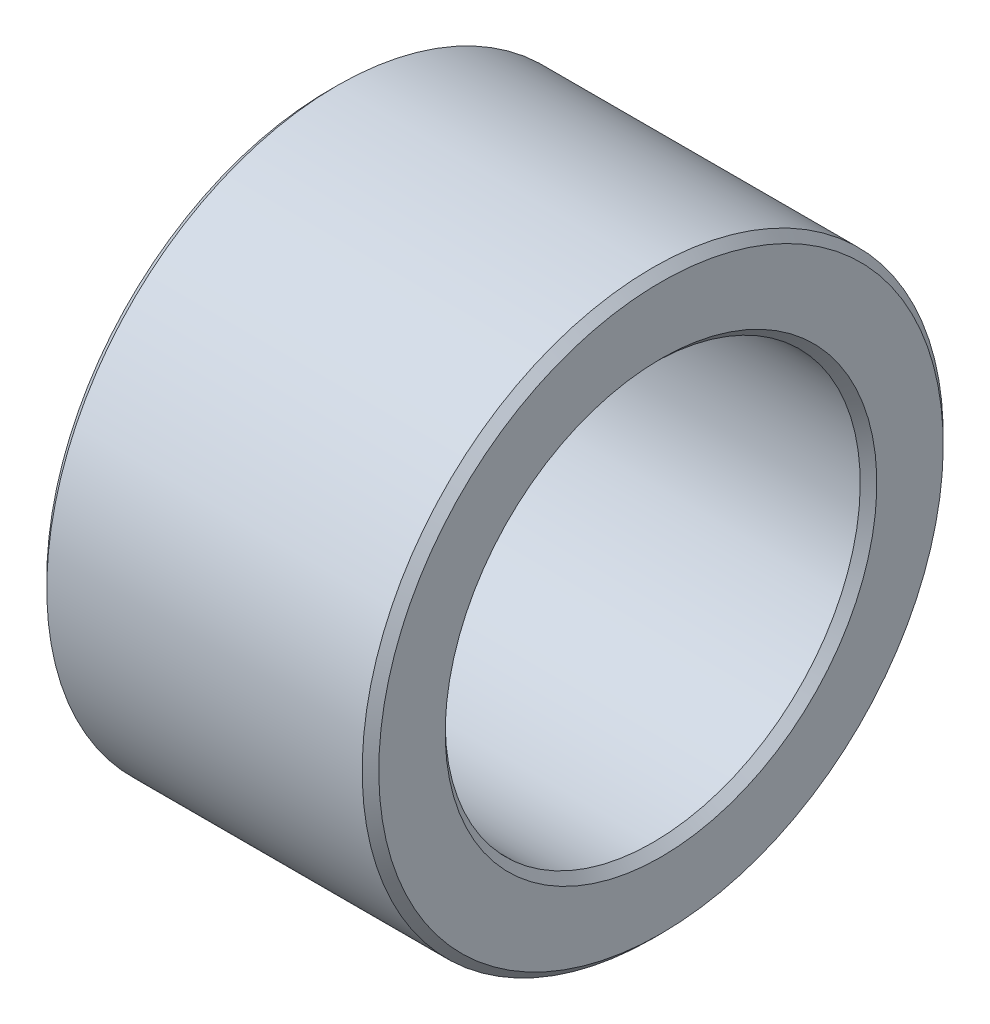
ISO-10303-21;
HEADER;
FILE_DESCRIPTION(('STEP AP214'),'2;1');
FILE_NAME('part.step','',(''),(''),'','','');
FILE_SCHEMA(('AUTOMOTIVE_DESIGN { 1 0 10303 214 1 1 1 1 }'));
ENDSEC;
DATA;
#1=APPLICATION_CONTEXT('core data for automotive mechanical design processes');
#2=APPLICATION_PROTOCOL_DEFINITION('international standard','automotive_design',2000,#1);
#3=PRODUCT_CONTEXT('',#1,'mechanical');
#4=PRODUCT('Part','Part','',(#3));
#5=PRODUCT_RELATED_PRODUCT_CATEGORY('part','',(#4));
#6=PRODUCT_DEFINITION_FORMATION('','',#4);
#7=PRODUCT_DEFINITION_CONTEXT('part definition',#1,'design');
#8=PRODUCT_DEFINITION('design','',#6,#7);
#9=PRODUCT_DEFINITION_SHAPE('','',#8);
#10=(LENGTH_UNIT() NAMED_UNIT(*) SI_UNIT(.MILLI.,.METRE.));
#11=(NAMED_UNIT(*) PLANE_ANGLE_UNIT() SI_UNIT($,.RADIAN.));
#12=(NAMED_UNIT(*) SI_UNIT($,.STERADIAN.) SOLID_ANGLE_UNIT());
#13=UNCERTAINTY_MEASURE_WITH_UNIT(LENGTH_MEASURE(1.E-05),#10,'distance_accuracy_value','');
#14=(GEOMETRIC_REPRESENTATION_CONTEXT(3) GLOBAL_UNCERTAINTY_ASSIGNED_CONTEXT((#13)) GLOBAL_UNIT_ASSIGNED_CONTEXT((#10,
#11,#12)) REPRESENTATION_CONTEXT('',''));
#15=CARTESIAN_POINT('',(0.,0.,0.));
#16=DIRECTION('',(0.,0.,1.));
#17=DIRECTION('',(1.,0.,0.));
#18=AXIS2_PLACEMENT_3D('',#15,#16,#17);
#19=CARTESIAN_POINT('',(0.,-12.,0.));
#20=DIRECTION('',(-1.,0.,0.));
#21=DIRECTION('',(0.,1.,0.));
#22=AXIS2_PLACEMENT_3D('',#19,#20,#21);
#23=PLANE('',#22);
#24=CARTESIAN_POINT('',(0.,0.,0.));
#25=DIRECTION('',(1.,0.,0.));
#26=DIRECTION('',(0.,-1.,0.));
#27=AXIS2_PLACEMENT_3D('',#24,#25,#26);
#28=CIRCLE('',#27,10.4);
#29=CARTESIAN_POINT('',(0.,-10.4,0.));
#30=VERTEX_POINT('',#29);
#31=EDGE_CURVE('E9',#30,#30,#28,.T.);
#32=ORIENTED_EDGE('',*,*,#31,.T.);
#33=EDGE_LOOP('',(#32));
#34=FACE_BOUND('',#33,.T.);
#35=CARTESIAN_POINT('',(0.,0.,0.));
#36=DIRECTION('',(1.,0.,0.));
#37=DIRECTION('',(0.,-1.,0.));
#38=AXIS2_PLACEMENT_3D('',#35,#36,#37);
#39=CIRCLE('',#38,13.6);
#40=CARTESIAN_POINT('',(0.,-13.6,0.));
#41=VERTEX_POINT('',#40);
#42=EDGE_CURVE('E53',#41,#41,#39,.T.);
#43=ORIENTED_EDGE('',*,*,#42,.F.);
#44=EDGE_LOOP('',(#43));
#45=FACE_BOUND('',#44,.T.);
#46=ADVANCED_FACE('F15',(#34,#45),#23,.T.);
#47=CARTESIAN_POINT('',(0.2,0.,0.));
#48=DIRECTION('',(-1.,0.,0.));
#49=DIRECTION('',(0.,-1.,0.));
#50=AXIS2_PLACEMENT_3D('',#47,#48,#49);
#51=CONICAL_SURFACE('',#50,10.2,0.785398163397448);
#52=CARTESIAN_POINT('',(0.4,0.,0.));
#53=DIRECTION('',(1.,0.,0.));
#54=DIRECTION('',(0.,-1.,0.));
#55=AXIS2_PLACEMENT_3D('',#52,#53,#54);
#56=CIRCLE('',#55,10.);
#57=CARTESIAN_POINT('',(0.4,-10.,0.));
#58=VERTEX_POINT('',#57);
#59=EDGE_CURVE('E22',#58,#58,#56,.T.);
#60=ORIENTED_EDGE('',*,*,#59,.T.);
#61=EDGE_LOOP('',(#60));
#62=FACE_BOUND('',#61,.T.);
#63=ORIENTED_EDGE('',*,*,#31,.F.);
#64=EDGE_LOOP('',(#63));
#65=FACE_BOUND('',#64,.T.);
#66=ADVANCED_FACE('F82',(#62,#65),#51,.F.);
#67=CARTESIAN_POINT('',(8.,0.,0.));
#68=DIRECTION('',(-1.,0.,0.));
#69=DIRECTION('',(0.,-1.,0.));
#70=AXIS2_PLACEMENT_3D('',#67,#68,#69);
#71=CYLINDRICAL_SURFACE('',#70,10.);
#72=CARTESIAN_POINT('',(15.6,0.,0.));
#73=DIRECTION('',(1.,0.,0.));
#74=DIRECTION('',(0.,-1.,0.));
#75=AXIS2_PLACEMENT_3D('',#72,#73,#74);
#76=CIRCLE('',#75,10.);
#77=CARTESIAN_POINT('',(15.6,-10.,0.));
#78=VERTEX_POINT('',#77);
#79=EDGE_CURVE('E58',#78,#78,#76,.T.);
#80=ORIENTED_EDGE('',*,*,#79,.T.);
#81=EDGE_LOOP('',(#80));
#82=FACE_BOUND('',#81,.T.);
#83=ORIENTED_EDGE('',*,*,#59,.F.);
#84=EDGE_LOOP('',(#83));
#85=FACE_BOUND('',#84,.T.);
#86=ADVANCED_FACE('F66',(#82,#85),#71,.F.);
#87=CARTESIAN_POINT('',(15.8,0.,0.));
#88=DIRECTION('',(1.,0.,0.));
#89=DIRECTION('',(0.,-1.,0.));
#90=AXIS2_PLACEMENT_3D('',#87,#88,#89);
#91=CONICAL_SURFACE('',#90,10.2,0.785398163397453);
#92=CARTESIAN_POINT('',(16.,0.,0.));
#93=DIRECTION('',(1.,0.,0.));
#94=DIRECTION('',(0.,-1.,0.));
#95=AXIS2_PLACEMENT_3D('',#92,#93,#94);
#96=CIRCLE('',#95,10.4);
#97=CARTESIAN_POINT('',(16.,-10.4,0.));
#98=VERTEX_POINT('',#97);
#99=EDGE_CURVE('E63',#98,#98,#96,.T.);
#100=ORIENTED_EDGE('',*,*,#99,.T.);
#101=EDGE_LOOP('',(#100));
#102=FACE_BOUND('',#101,.T.);
#103=ORIENTED_EDGE('',*,*,#79,.F.);
#104=EDGE_LOOP('',(#103));
#105=FACE_BOUND('',#104,.T.);
#106=ADVANCED_FACE('F69',(#102,#105),#91,.F.);
#107=CARTESIAN_POINT('',(16.,-12.,0.));
#108=DIRECTION('',(1.,0.,0.));
#109=DIRECTION('',(0.,-1.,0.));
#110=AXIS2_PLACEMENT_3D('',#107,#108,#109);
#111=PLANE('',#110);
#112=CARTESIAN_POINT('',(16.,0.,0.));
#113=DIRECTION('',(1.,0.,0.));
#114=DIRECTION('',(0.,-1.,0.));
#115=AXIS2_PLACEMENT_3D('',#112,#113,#114);
#116=CIRCLE('',#115,13.6);
#117=CARTESIAN_POINT('',(16.,-13.6,0.));
#118=VERTEX_POINT('',#117);
#119=EDGE_CURVE('E61',#118,#118,#116,.T.);
#120=ORIENTED_EDGE('',*,*,#119,.T.);
#121=EDGE_LOOP('',(#120));
#122=FACE_BOUND('',#121,.T.);
#123=ORIENTED_EDGE('',*,*,#99,.F.);
#124=EDGE_LOOP('',(#123));
#125=FACE_BOUND('',#124,.T.);
#126=ADVANCED_FACE('F71',(#122,#125),#111,.T.);
#127=CARTESIAN_POINT('',(15.8,0.,0.));
#128=DIRECTION('',(-1.,0.,0.));
#129=DIRECTION('',(0.,-1.,0.));
#130=AXIS2_PLACEMENT_3D('',#127,#128,#129);
#131=CONICAL_SURFACE('',#130,13.8,0.785398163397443);
#132=CARTESIAN_POINT('',(15.6,0.,0.));
#133=DIRECTION('',(1.,0.,0.));
#134=DIRECTION('',(0.,-1.,0.));
#135=AXIS2_PLACEMENT_3D('',#132,#133,#134);
#136=CIRCLE('',#135,14.);
#137=CARTESIAN_POINT('',(15.6,-14.,0.));
#138=VERTEX_POINT('',#137);
#139=EDGE_CURVE('E55',#138,#138,#136,.T.);
#140=ORIENTED_EDGE('',*,*,#139,.T.);
#141=EDGE_LOOP('',(#140));
#142=FACE_BOUND('',#141,.T.);
#143=ORIENTED_EDGE('',*,*,#119,.F.);
#144=EDGE_LOOP('',(#143));
#145=FACE_BOUND('',#144,.T.);
#146=ADVANCED_FACE('F79',(#142,#145),#131,.T.);
#147=CARTESIAN_POINT('',(8.,0.,0.));
#148=DIRECTION('',(-1.,0.,0.));
#149=DIRECTION('',(0.,-1.,0.));
#150=AXIS2_PLACEMENT_3D('',#147,#148,#149);
#151=CYLINDRICAL_SURFACE('',#150,14.);
#152=CARTESIAN_POINT('',(0.4,0.,0.));
#153=DIRECTION('',(1.,0.,0.));
#154=DIRECTION('',(0.,-1.,0.));
#155=AXIS2_PLACEMENT_3D('',#152,#153,#154);
#156=CIRCLE('',#155,14.);
#157=CARTESIAN_POINT('',(0.4,-14.,0.));
#158=VERTEX_POINT('',#157);
#159=EDGE_CURVE('E49',#158,#158,#156,.T.);
#160=ORIENTED_EDGE('',*,*,#159,.T.);
#161=EDGE_LOOP('',(#160));
#162=FACE_BOUND('',#161,.T.);
#163=ORIENTED_EDGE('',*,*,#139,.F.);
#164=EDGE_LOOP('',(#163));
#165=FACE_BOUND('',#164,.T.);
#166=ADVANCED_FACE('F50',(#162,#165),#151,.T.);
#167=CARTESIAN_POINT('',(0.2,0.,0.));
#168=DIRECTION('',(1.,0.,0.));
#169=DIRECTION('',(0.,-1.,0.));
#170=AXIS2_PLACEMENT_3D('',#167,#168,#169);
#171=CONICAL_SURFACE('',#170,13.8,0.785398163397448);
#172=ORIENTED_EDGE('',*,*,#42,.T.);
#173=EDGE_LOOP('',(#172));
#174=FACE_BOUND('',#173,.T.);
#175=ORIENTED_EDGE('',*,*,#159,.F.);
#176=EDGE_LOOP('',(#175));
#177=FACE_BOUND('',#176,.T.);
#178=ADVANCED_FACE('F92',(#174,#177),#171,.T.);
#179=CLOSED_SHELL('',(#46,#66,#86,#106,#126,#146,#166,#178));
#180=MANIFOLD_SOLID_BREP('B1',#179);
#181=ADVANCED_BREP_SHAPE_REPRESENTATION('',(#18,#180),#14);
#182=SHAPE_DEFINITION_REPRESENTATION(#9,#181);
ENDSEC;
END-ISO-10303-21;
